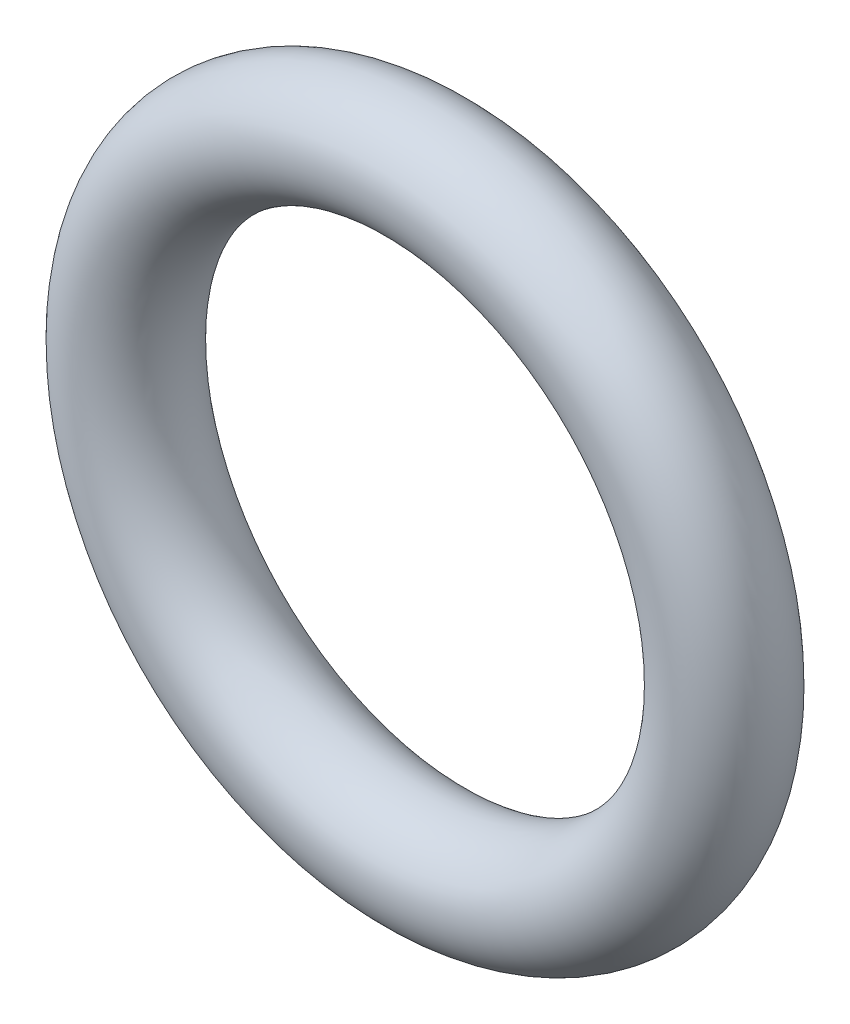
from build123d import *

# Parameters (mm, degrees)
SKETCH3_R = 0.889


with BuildPart() as part:
    # Sweep2: sweep along a path in Sketch1
    with BuildLine(Plane.XY) as sweep2_path:
        CenterArc((0, 0), 4.7117, 0, 360)
    # Sketch3 → Sweep2 (sweep)
    with BuildSketch(Plane(origin=(0, 0, 0), x_dir=(0, 0, -1), z_dir=(1, 0, 0))):
        with Locations((0, 4.7117)):
            Circle(SKETCH3_R)
    sweep(path=sweep2_path.line)


solid = part.part
